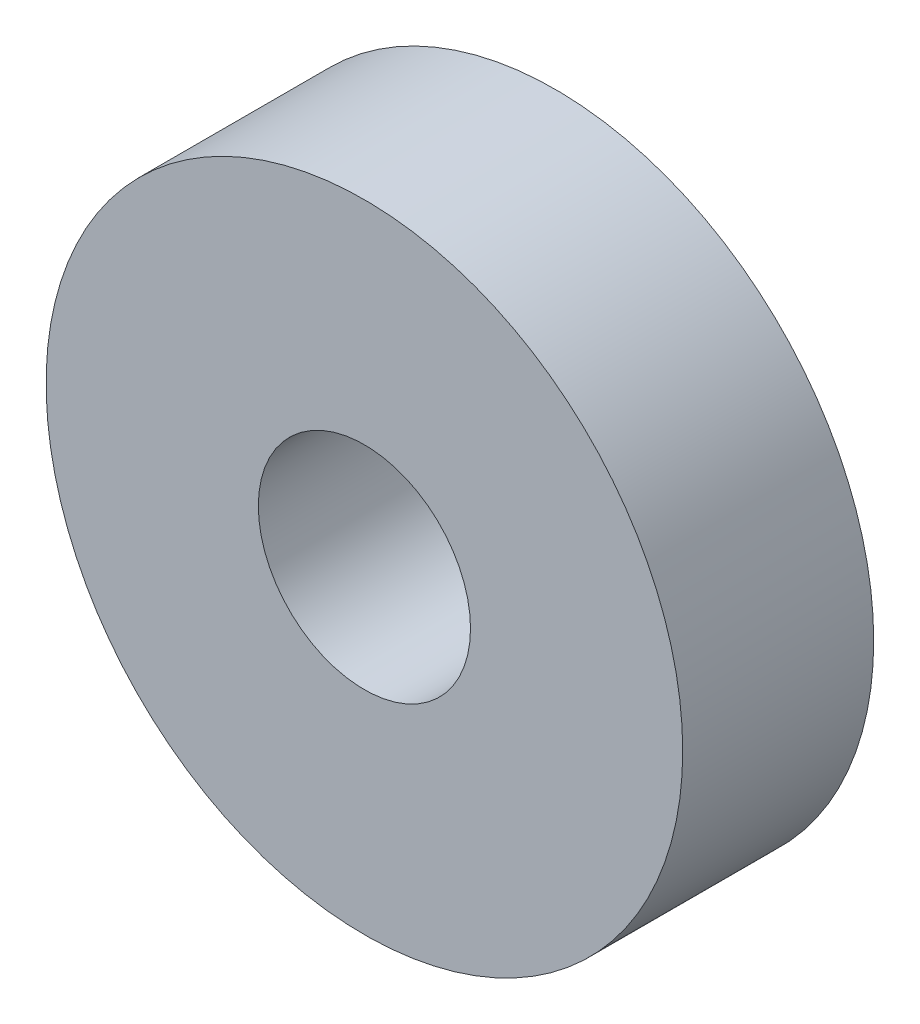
ISO-10303-21;
HEADER;
FILE_DESCRIPTION(('STEP AP214'),'2;1');
FILE_NAME('part.step','',(''),(''),'','','');
FILE_SCHEMA(('AUTOMOTIVE_DESIGN { 1 0 10303 214 1 1 1 1 }'));
ENDSEC;
DATA;
#1=APPLICATION_CONTEXT('core data for automotive mechanical design processes');
#2=APPLICATION_PROTOCOL_DEFINITION('international standard','automotive_design',2000,#1);
#3=PRODUCT_CONTEXT('',#1,'mechanical');
#4=PRODUCT('Part','Part','',(#3));
#5=PRODUCT_RELATED_PRODUCT_CATEGORY('part','',(#4));
#6=PRODUCT_DEFINITION_FORMATION('','',#4);
#7=PRODUCT_DEFINITION_CONTEXT('part definition',#1,'design');
#8=PRODUCT_DEFINITION('design','',#6,#7);
#9=PRODUCT_DEFINITION_SHAPE('','',#8);
#10=(LENGTH_UNIT() NAMED_UNIT(*) SI_UNIT(.MILLI.,.METRE.));
#11=(NAMED_UNIT(*) PLANE_ANGLE_UNIT() SI_UNIT($,.RADIAN.));
#12=(NAMED_UNIT(*) SI_UNIT($,.STERADIAN.) SOLID_ANGLE_UNIT());
#13=UNCERTAINTY_MEASURE_WITH_UNIT(LENGTH_MEASURE(1.E-05),#10,'distance_accuracy_value','');
#14=(GEOMETRIC_REPRESENTATION_CONTEXT(3) GLOBAL_UNCERTAINTY_ASSIGNED_CONTEXT((#13)) GLOBAL_UNIT_ASSIGNED_CONTEXT((#10,
#11,#12)) REPRESENTATION_CONTEXT('',''));
#15=CARTESIAN_POINT('',(0.,0.,0.));
#16=DIRECTION('',(0.,0.,1.));
#17=DIRECTION('',(1.,0.,0.));
#18=AXIS2_PLACEMENT_3D('',#15,#16,#17);
#19=CARTESIAN_POINT('',(0.,0.,0.9));
#20=DIRECTION('',(0.,0.,1.));
#21=DIRECTION('',(1.,0.,0.));
#22=AXIS2_PLACEMENT_3D('',#19,#20,#21);
#23=PLANE('',#22);
#24=CARTESIAN_POINT('',(0.,0.,0.9));
#25=DIRECTION('',(0.,0.,1.));
#26=DIRECTION('',(1.,0.,0.));
#27=AXIS2_PLACEMENT_3D('',#24,#25,#26);
#28=CIRCLE('',#27,1.5);
#29=CARTESIAN_POINT('',(1.5,0.,0.9));
#30=VERTEX_POINT('',#29);
#31=EDGE_CURVE('E10',#30,#30,#28,.T.);
#32=ORIENTED_EDGE('',*,*,#31,.T.);
#33=EDGE_LOOP('',(#32));
#34=FACE_BOUND('',#33,.T.);
#35=CARTESIAN_POINT('',(0.,0.,0.9));
#36=DIRECTION('',(0.,0.,1.));
#37=DIRECTION('',(1.,0.,0.));
#38=AXIS2_PLACEMENT_3D('',#35,#36,#37);
#39=CIRCLE('',#38,0.5);
#40=CARTESIAN_POINT('',(0.5,0.,0.9));
#41=VERTEX_POINT('',#40);
#42=EDGE_CURVE('E52',#41,#41,#39,.T.);
#43=ORIENTED_EDGE('',*,*,#42,.F.);
#44=EDGE_LOOP('',(#43));
#45=FACE_BOUND('',#44,.T.);
#46=ADVANCED_FACE('F39',(#34,#45),#23,.T.);
#47=CARTESIAN_POINT('',(0.,0.,0.));
#48=DIRECTION('',(0.,0.,1.));
#49=DIRECTION('',(1.,0.,0.));
#50=AXIS2_PLACEMENT_3D('',#47,#48,#49);
#51=PLANE('',#50);
#52=CARTESIAN_POINT('',(0.,0.,0.));
#53=DIRECTION('',(0.,0.,1.));
#54=DIRECTION('',(1.,0.,0.));
#55=AXIS2_PLACEMENT_3D('',#52,#53,#54);
#56=CIRCLE('',#55,1.5);
#57=CARTESIAN_POINT('',(1.5,0.,0.));
#58=VERTEX_POINT('',#57);
#59=EDGE_CURVE('E43',#58,#58,#56,.T.);
#60=ORIENTED_EDGE('',*,*,#59,.F.);
#61=EDGE_LOOP('',(#60));
#62=FACE_BOUND('',#61,.T.);
#63=CARTESIAN_POINT('',(0.,0.,0.));
#64=DIRECTION('',(0.,0.,1.));
#65=DIRECTION('',(1.,0.,0.));
#66=AXIS2_PLACEMENT_3D('',#63,#64,#65);
#67=CIRCLE('',#66,0.5);
#68=CARTESIAN_POINT('',(0.5,0.,0.));
#69=VERTEX_POINT('',#68);
#70=EDGE_CURVE('E54',#69,#69,#67,.T.);
#71=ORIENTED_EDGE('',*,*,#70,.T.);
#72=EDGE_LOOP('',(#71));
#73=FACE_BOUND('',#72,.T.);
#74=ADVANCED_FACE('F66',(#62,#73),#51,.F.);
#75=CARTESIAN_POINT('',(0.,0.,0.9));
#76=DIRECTION('',(0.,0.,-1.));
#77=DIRECTION('',(-1.,0.,0.));
#78=AXIS2_PLACEMENT_3D('',#75,#76,#77);
#79=CYLINDRICAL_SURFACE('',#78,1.5);
#80=ORIENTED_EDGE('',*,*,#31,.F.);
#81=EDGE_LOOP('',(#80));
#82=FACE_BOUND('',#81,.T.);
#83=ORIENTED_EDGE('',*,*,#59,.T.);
#84=EDGE_LOOP('',(#83));
#85=FACE_BOUND('',#84,.T.);
#86=ADVANCED_FACE('F41',(#82,#85),#79,.T.);
#87=CARTESIAN_POINT('',(0.,0.,0.9));
#88=DIRECTION('',(0.,0.,-1.));
#89=DIRECTION('',(-1.,0.,0.));
#90=AXIS2_PLACEMENT_3D('',#87,#88,#89);
#91=CYLINDRICAL_SURFACE('',#90,0.5);
#92=ORIENTED_EDGE('',*,*,#42,.T.);
#93=EDGE_LOOP('',(#92));
#94=FACE_BOUND('',#93,.T.);
#95=ORIENTED_EDGE('',*,*,#70,.F.);
#96=EDGE_LOOP('',(#95));
#97=FACE_BOUND('',#96,.T.);
#98=ADVANCED_FACE('F62',(#94,#97),#91,.F.);
#99=CLOSED_SHELL('',(#46,#74,#86,#98));
#100=MANIFOLD_SOLID_BREP('B2',#99);
#101=ADVANCED_BREP_SHAPE_REPRESENTATION('',(#18,#100),#14);
#102=SHAPE_DEFINITION_REPRESENTATION(#9,#101);
ENDSEC;
END-ISO-10303-21;
